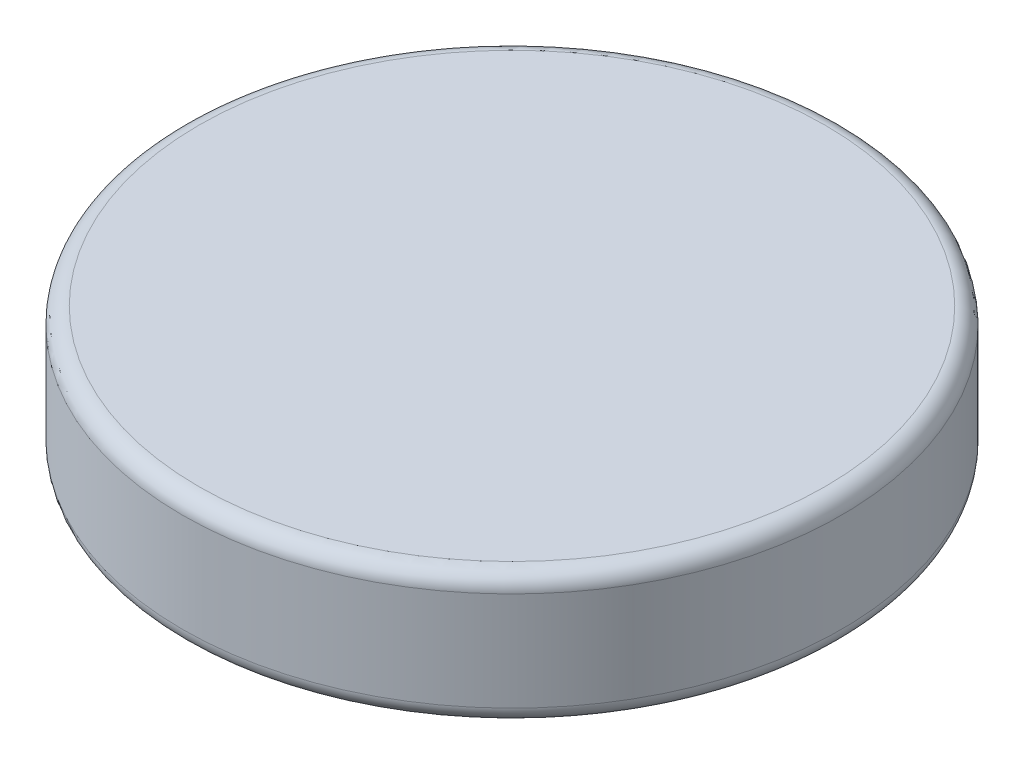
ISO-10303-21;
HEADER;
FILE_DESCRIPTION(('STEP AP214'),'2;1');
FILE_NAME('part.step','',(''),(''),'','','');
FILE_SCHEMA(('AUTOMOTIVE_DESIGN { 1 0 10303 214 1 1 1 1 }'));
ENDSEC;
DATA;
#1=APPLICATION_CONTEXT('core data for automotive mechanical design processes');
#2=APPLICATION_PROTOCOL_DEFINITION('international standard','automotive_design',2000,#1);
#3=PRODUCT_CONTEXT('',#1,'mechanical');
#4=PRODUCT('Part','Part','',(#3));
#5=PRODUCT_RELATED_PRODUCT_CATEGORY('part','',(#4));
#6=PRODUCT_DEFINITION_FORMATION('','',#4);
#7=PRODUCT_DEFINITION_CONTEXT('part definition',#1,'design');
#8=PRODUCT_DEFINITION('design','',#6,#7);
#9=PRODUCT_DEFINITION_SHAPE('','',#8);
#10=(LENGTH_UNIT() NAMED_UNIT(*) SI_UNIT(.MILLI.,.METRE.));
#11=(NAMED_UNIT(*) PLANE_ANGLE_UNIT() SI_UNIT($,.RADIAN.));
#12=(NAMED_UNIT(*) SI_UNIT($,.STERADIAN.) SOLID_ANGLE_UNIT());
#13=UNCERTAINTY_MEASURE_WITH_UNIT(LENGTH_MEASURE(1.E-05),#10,'distance_accuracy_value','');
#14=(GEOMETRIC_REPRESENTATION_CONTEXT(3) GLOBAL_UNCERTAINTY_ASSIGNED_CONTEXT((#13)) GLOBAL_UNIT_ASSIGNED_CONTEXT((#10,
#11,#12)) REPRESENTATION_CONTEXT('',''));
#15=CARTESIAN_POINT('',(0.,0.,0.));
#16=DIRECTION('',(0.,0.,1.));
#17=DIRECTION('',(1.,0.,0.));
#18=AXIS2_PLACEMENT_3D('',#15,#16,#17);
#19=CARTESIAN_POINT('',(0.,4.,0.));
#20=DIRECTION('',(0.,-1.,0.));
#21=DIRECTION('',(0.,0.,-1.));
#22=AXIS2_PLACEMENT_3D('',#19,#20,#21);
#23=CYLINDRICAL_SURFACE('',#22,10.);
#24=CARTESIAN_POINT('',(0.,0.5,0.));
#25=DIRECTION('',(0.,1.,0.));
#26=DIRECTION('',(0.,0.,1.));
#27=AXIS2_PLACEMENT_3D('',#24,#25,#26);
#28=CIRCLE('',#27,10.);
#29=CARTESIAN_POINT('',(0.,0.5,10.));
#30=VERTEX_POINT('',#29);
#31=EDGE_CURVE('E37',#30,#30,#28,.T.);
#32=ORIENTED_EDGE('',*,*,#31,.T.);
#33=EDGE_LOOP('',(#32));
#34=FACE_BOUND('',#33,.T.);
#35=CARTESIAN_POINT('',(0.,3.5,0.));
#36=DIRECTION('',(0.,1.,0.));
#37=DIRECTION('',(0.,0.,1.));
#38=AXIS2_PLACEMENT_3D('',#35,#36,#37);
#39=CIRCLE('',#38,10.);
#40=CARTESIAN_POINT('',(0.,3.5,10.));
#41=VERTEX_POINT('',#40);
#42=EDGE_CURVE('E41',#41,#41,#39,.F.);
#43=ORIENTED_EDGE('',*,*,#42,.T.);
#44=EDGE_LOOP('',(#43));
#45=FACE_BOUND('',#44,.T.);
#46=ADVANCED_FACE('F30',(#34,#45),#23,.T.);
#47=CARTESIAN_POINT('',(0.,4.,0.));
#48=DIRECTION('',(0.,1.,0.));
#49=DIRECTION('',(0.,0.,1.));
#50=AXIS2_PLACEMENT_3D('',#47,#48,#49);
#51=PLANE('',#50);
#52=CARTESIAN_POINT('',(0.,4.,0.));
#53=DIRECTION('',(0.,1.,0.));
#54=DIRECTION('',(0.,0.,1.));
#55=AXIS2_PLACEMENT_3D('',#52,#53,#54);
#56=CIRCLE('',#55,9.5);
#57=CARTESIAN_POINT('',(0.,4.,9.5));
#58=VERTEX_POINT('',#57);
#59=EDGE_CURVE('E45',#58,#58,#56,.T.);
#60=ORIENTED_EDGE('',*,*,#59,.T.);
#61=EDGE_LOOP('',(#60));
#62=FACE_BOUND('',#61,.T.);
#63=ADVANCED_FACE('F51',(#62),#51,.T.);
#64=CARTESIAN_POINT('',(0.,0.,0.));
#65=DIRECTION('',(0.,1.,0.));
#66=DIRECTION('',(0.,0.,1.));
#67=AXIS2_PLACEMENT_3D('',#64,#65,#66);
#68=PLANE('',#67);
#69=CARTESIAN_POINT('',(0.,0.,0.));
#70=DIRECTION('',(0.,1.,0.));
#71=DIRECTION('',(0.,0.,1.));
#72=AXIS2_PLACEMENT_3D('',#69,#70,#71);
#73=CIRCLE('',#72,9.5);
#74=CARTESIAN_POINT('',(0.,0.,9.5));
#75=VERTEX_POINT('',#74);
#76=EDGE_CURVE('E10',#75,#75,#73,.F.);
#77=ORIENTED_EDGE('',*,*,#76,.T.);
#78=EDGE_LOOP('',(#77));
#79=FACE_BOUND('',#78,.T.);
#80=ADVANCED_FACE('F55',(#79),#68,.F.);
#81=CARTESIAN_POINT('',(0.,3.5,0.));
#82=DIRECTION('',(0.,1.,0.));
#83=DIRECTION('',(0.,0.,1.));
#84=AXIS2_PLACEMENT_3D('',#81,#82,#83);
#85=TOROIDAL_SURFACE('',#84,9.5,0.5);
#86=ORIENTED_EDGE('',*,*,#42,.F.);
#87=EDGE_LOOP('',(#86));
#88=FACE_BOUND('',#87,.T.);
#89=ORIENTED_EDGE('',*,*,#59,.F.);
#90=EDGE_LOOP('',(#89));
#91=FACE_BOUND('',#90,.T.);
#92=ADVANCED_FACE('F53',(#88,#91),#85,.T.);
#93=CARTESIAN_POINT('',(0.,0.5,0.));
#94=DIRECTION('',(0.,1.,0.));
#95=DIRECTION('',(0.,0.,1.));
#96=AXIS2_PLACEMENT_3D('',#93,#94,#95);
#97=TOROIDAL_SURFACE('',#96,9.5,0.5);
#98=ORIENTED_EDGE('',*,*,#76,.F.);
#99=EDGE_LOOP('',(#98));
#100=FACE_BOUND('',#99,.T.);
#101=ORIENTED_EDGE('',*,*,#31,.F.);
#102=EDGE_LOOP('',(#101));
#103=FACE_BOUND('',#102,.T.);
#104=ADVANCED_FACE('F32',(#100,#103),#97,.T.);
#105=CLOSED_SHELL('',(#46,#63,#80,#92,#104));
#106=MANIFOLD_SOLID_BREP('B2',#105);
#107=ADVANCED_BREP_SHAPE_REPRESENTATION('',(#18,#106),#14);
#108=SHAPE_DEFINITION_REPRESENTATION(#9,#107);
ENDSEC;
END-ISO-10303-21;
